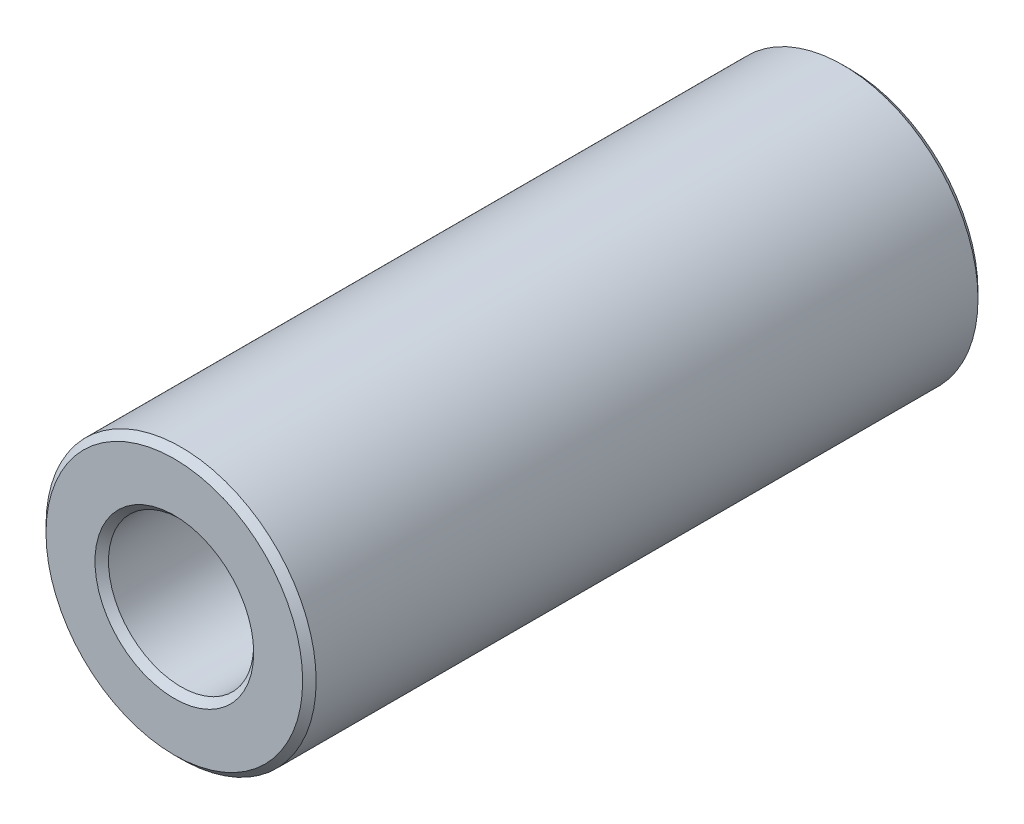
from build123d import *

# Parameters (mm, degrees)
SKETCH1_R           = 4
SKETCH1_R_2         = 2.15
BOSS_EXTRUDE2_DEPTH = 10
CHAMFER3_SIZE       = 0.2


with BuildPart() as part:
    # Sketch1 → Boss-Extrude2 (new, symmetric)
    with BuildSketch(Plane.XY):
        Circle(SKETCH1_R)
        Circle(SKETCH1_R_2, mode=Mode.SUBTRACT)
    extrude(amount=BOSS_EXTRUDE2_DEPTH, both=True)

    # Chamfer3
    chamfer3_edges = [part.edges().sort_by_distance(p)[0] for p in [
        (-4, 0, -10),
        (-4, 0, 10),
        (-2.15, 0, -10),
        (-2.15, 0, 10),
    ]]
    chamfer(chamfer3_edges, length=CHAMFER3_SIZE)


solid = part.part
